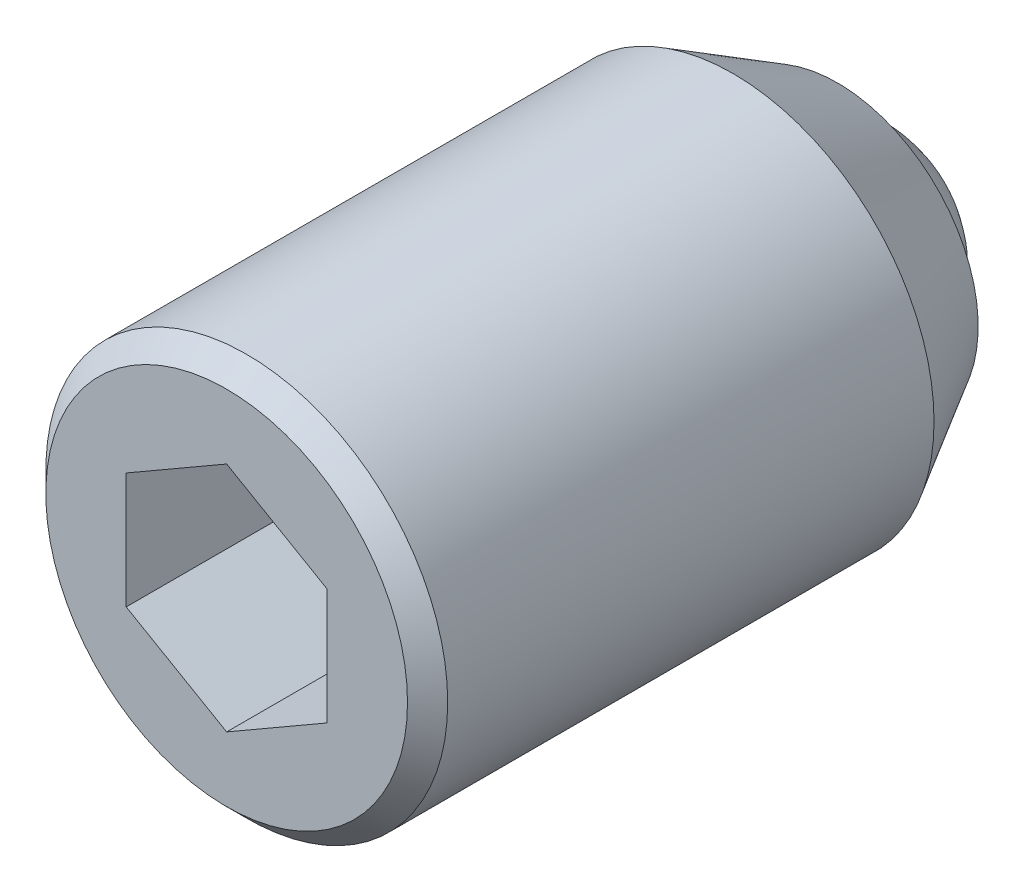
ISO-10303-21;
HEADER;
FILE_DESCRIPTION(('STEP AP214'),'2;1');
FILE_NAME('part.step','',(''),(''),'','','');
FILE_SCHEMA(('AUTOMOTIVE_DESIGN { 1 0 10303 214 1 1 1 1 }'));
ENDSEC;
DATA;
#1=APPLICATION_CONTEXT('core data for automotive mechanical design processes');
#2=APPLICATION_PROTOCOL_DEFINITION('international standard','automotive_design',2000,#1);
#3=PRODUCT_CONTEXT('',#1,'mechanical');
#4=PRODUCT('Part','Part','',(#3));
#5=PRODUCT_RELATED_PRODUCT_CATEGORY('part','',(#4));
#6=PRODUCT_DEFINITION_FORMATION('','',#4);
#7=PRODUCT_DEFINITION_CONTEXT('part definition',#1,'design');
#8=PRODUCT_DEFINITION('design','',#6,#7);
#9=PRODUCT_DEFINITION_SHAPE('','',#8);
#10=(LENGTH_UNIT() NAMED_UNIT(*) SI_UNIT(.MILLI.,.METRE.));
#11=(NAMED_UNIT(*) PLANE_ANGLE_UNIT() SI_UNIT($,.RADIAN.));
#12=(NAMED_UNIT(*) SI_UNIT($,.STERADIAN.) SOLID_ANGLE_UNIT());
#13=UNCERTAINTY_MEASURE_WITH_UNIT(LENGTH_MEASURE(1.E-05),#10,'distance_accuracy_value','');
#14=(GEOMETRIC_REPRESENTATION_CONTEXT(3) GLOBAL_UNCERTAINTY_ASSIGNED_CONTEXT((#13)) GLOBAL_UNIT_ASSIGNED_CONTEXT((#10,
#11,#12)) REPRESENTATION_CONTEXT('',''));
#15=CARTESIAN_POINT('',(0.,0.,0.));
#16=DIRECTION('',(0.,0.,1.));
#17=DIRECTION('',(1.,0.,0.));
#18=AXIS2_PLACEMENT_3D('',#15,#16,#17);
#19=CARTESIAN_POINT('',(1.25,0.721687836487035,6.1));
#20=DIRECTION('',(0.5,0.866025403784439,0.));
#21=DIRECTION('',(0.866025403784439,-0.5,0.));
#22=AXIS2_PLACEMENT_3D('',#19,#20,#21);
#23=PLANE('',#22);
#24=DIRECTION('',(0.,0.,1.));
#25=VECTOR('',#24,1.);
#26=CARTESIAN_POINT('',(1.25,0.721687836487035,6.1));
#27=LINE('',#26,#25);
#28=CARTESIAN_POINT('',(1.25,0.721687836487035,6.1));
#29=VERTEX_POINT('',#28);
#30=CARTESIAN_POINT('',(1.25,0.721687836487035,8.6));
#31=VERTEX_POINT('',#30);
#32=EDGE_CURVE('E96',#29,#31,#27,.T.);
#33=ORIENTED_EDGE('',*,*,#32,.T.);
#34=DIRECTION('',(-0.866025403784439,0.5,0.));
#35=VECTOR('',#34,1.);
#36=CARTESIAN_POINT('',(1.25,0.721687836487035,8.6));
#37=LINE('',#36,#35);
#38=CARTESIAN_POINT('',(0.,1.44337567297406,8.6));
#39=VERTEX_POINT('',#38);
#40=EDGE_CURVE('E29',#31,#39,#37,.T.);
#41=ORIENTED_EDGE('',*,*,#40,.T.);
#42=DIRECTION('',(0.,0.,1.));
#43=VECTOR('',#42,1.);
#44=CARTESIAN_POINT('',(0.,1.44337567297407,6.1));
#45=LINE('',#44,#43);
#46=CARTESIAN_POINT('',(0.,1.44337567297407,6.1));
#47=VERTEX_POINT('',#46);
#48=EDGE_CURVE('E34',#47,#39,#45,.T.);
#49=ORIENTED_EDGE('',*,*,#48,.F.);
#50=DIRECTION('',(-0.866025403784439,0.5,0.));
#51=VECTOR('',#50,1.);
#52=CARTESIAN_POINT('',(1.25,0.721687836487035,6.1));
#53=LINE('',#52,#51);
#54=EDGE_CURVE('E90',#29,#47,#53,.T.);
#55=ORIENTED_EDGE('',*,*,#54,.F.);
#56=EDGE_LOOP('',(#33,#41,#49,#55));
#57=FACE_BOUND('',#56,.T.);
#58=ADVANCED_FACE('F14',(#57),#23,.F.);
#59=CARTESIAN_POINT('',(1.25,-0.721687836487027,6.1));
#60=DIRECTION('',(1.,0.,0.));
#61=DIRECTION('',(0.,-1.,0.));
#62=AXIS2_PLACEMENT_3D('',#59,#60,#61);
#63=PLANE('',#62);
#64=DIRECTION('',(0.,0.,1.));
#65=VECTOR('',#64,1.);
#66=CARTESIAN_POINT('',(1.25,-0.721687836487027,6.1));
#67=LINE('',#66,#65);
#68=CARTESIAN_POINT('',(1.25,-0.721687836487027,6.1));
#69=VERTEX_POINT('',#68);
#70=CARTESIAN_POINT('',(1.25,-0.721687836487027,8.6));
#71=VERTEX_POINT('',#70);
#72=EDGE_CURVE('E93',#69,#71,#67,.T.);
#73=ORIENTED_EDGE('',*,*,#72,.T.);
#74=DIRECTION('',(0.,1.,0.));
#75=VECTOR('',#74,1.);
#76=CARTESIAN_POINT('',(1.25,-0.721687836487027,8.6));
#77=LINE('',#76,#75);
#78=EDGE_CURVE('E150',#71,#31,#77,.T.);
#79=ORIENTED_EDGE('',*,*,#78,.T.);
#80=ORIENTED_EDGE('',*,*,#32,.F.);
#81=DIRECTION('',(0.,1.,0.));
#82=VECTOR('',#81,1.);
#83=CARTESIAN_POINT('',(1.25,-0.721687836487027,6.1));
#84=LINE('',#83,#82);
#85=EDGE_CURVE('E85',#69,#29,#84,.T.);
#86=ORIENTED_EDGE('',*,*,#85,.F.);
#87=EDGE_LOOP('',(#73,#79,#80,#86));
#88=FACE_BOUND('',#87,.T.);
#89=ADVANCED_FACE('F119',(#88),#63,.F.);
#90=CARTESIAN_POINT('',(1.25,-0.721687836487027,6.1));
#91=DIRECTION('',(-0.5,0.866025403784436,0.));
#92=DIRECTION('',(0.866025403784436,0.5,0.));
#93=AXIS2_PLACEMENT_3D('',#90,#91,#92);
#94=PLANE('',#93);
#95=DIRECTION('',(0.,0.,1.));
#96=VECTOR('',#95,1.);
#97=CARTESIAN_POINT('',(0.,-1.44337567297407,6.1));
#98=LINE('',#97,#96);
#99=CARTESIAN_POINT('',(0.,-1.44337567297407,6.1));
#100=VERTEX_POINT('',#99);
#101=CARTESIAN_POINT('',(0.,-1.44337567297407,8.6));
#102=VERTEX_POINT('',#101);
#103=EDGE_CURVE('E68',#100,#102,#98,.T.);
#104=ORIENTED_EDGE('',*,*,#103,.T.);
#105=DIRECTION('',(-0.866025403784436,-0.5,0.));
#106=VECTOR('',#105,1.);
#107=CARTESIAN_POINT('',(1.25,-0.721687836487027,8.6));
#108=LINE('',#107,#106);
#109=EDGE_CURVE('E144',#71,#102,#108,.T.);
#110=ORIENTED_EDGE('',*,*,#109,.F.);
#111=ORIENTED_EDGE('',*,*,#72,.F.);
#112=DIRECTION('',(-0.866025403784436,-0.5,0.));
#113=VECTOR('',#112,1.);
#114=CARTESIAN_POINT('',(1.25,-0.721687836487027,6.1));
#115=LINE('',#114,#113);
#116=EDGE_CURVE('E83',#69,#100,#115,.T.);
#117=ORIENTED_EDGE('',*,*,#116,.T.);
#118=EDGE_LOOP('',(#104,#110,#111,#117));
#119=FACE_BOUND('',#118,.T.);
#120=ADVANCED_FACE('F124',(#119),#94,.T.);
#121=CARTESIAN_POINT('',(-1.25,-0.721687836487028,6.1));
#122=DIRECTION('',(-0.5,-0.866025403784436,0.));
#123=DIRECTION('',(-0.866025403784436,0.5,0.));
#124=AXIS2_PLACEMENT_3D('',#121,#122,#123);
#125=PLANE('',#124);
#126=DIRECTION('',(0.,0.,1.));
#127=VECTOR('',#126,1.);
#128=CARTESIAN_POINT('',(-1.25,-0.721687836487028,6.1));
#129=LINE('',#128,#127);
#130=CARTESIAN_POINT('',(-1.25,-0.721687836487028,6.1));
#131=VERTEX_POINT('',#130);
#132=CARTESIAN_POINT('',(-1.25,-0.721687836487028,8.6));
#133=VERTEX_POINT('',#132);
#134=EDGE_CURVE('E56',#131,#133,#129,.T.);
#135=ORIENTED_EDGE('',*,*,#134,.T.);
#136=DIRECTION('',(0.866025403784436,-0.5,0.));
#137=VECTOR('',#136,1.);
#138=CARTESIAN_POINT('',(-1.25,-0.721687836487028,8.6));
#139=LINE('',#138,#137);
#140=EDGE_CURVE('E147',#133,#102,#139,.T.);
#141=ORIENTED_EDGE('',*,*,#140,.T.);
#142=ORIENTED_EDGE('',*,*,#103,.F.);
#143=DIRECTION('',(0.866025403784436,-0.5,0.));
#144=VECTOR('',#143,1.);
#145=CARTESIAN_POINT('',(-1.25,-0.721687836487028,6.1));
#146=LINE('',#145,#144);
#147=EDGE_CURVE('E76',#131,#100,#146,.T.);
#148=ORIENTED_EDGE('',*,*,#147,.F.);
#149=EDGE_LOOP('',(#135,#141,#142,#148));
#150=FACE_BOUND('',#149,.T.);
#151=ADVANCED_FACE('F81',(#150),#125,.F.);
#152=CARTESIAN_POINT('',(-1.25,-0.721687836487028,6.1));
#153=DIRECTION('',(1.,0.,0.));
#154=DIRECTION('',(0.,0.,1.));
#155=AXIS2_PLACEMENT_3D('',#152,#153,#154);
#156=PLANE('',#155);
#157=DIRECTION('',(0.,0.,1.));
#158=VECTOR('',#157,1.);
#159=CARTESIAN_POINT('',(-1.25,0.72168783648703,6.1));
#160=LINE('',#159,#158);
#161=CARTESIAN_POINT('',(-1.25,0.72168783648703,6.1));
#162=VERTEX_POINT('',#161);
#163=CARTESIAN_POINT('',(-1.25,0.72168783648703,8.6));
#164=VERTEX_POINT('',#163);
#165=EDGE_CURVE('E69',#162,#164,#160,.T.);
#166=ORIENTED_EDGE('',*,*,#165,.T.);
#167=DIRECTION('',(0.,1.,0.));
#168=VECTOR('',#167,1.);
#169=CARTESIAN_POINT('',(-1.25,-0.721687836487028,8.6));
#170=LINE('',#169,#168);
#171=EDGE_CURVE('E63',#133,#164,#170,.T.);
#172=ORIENTED_EDGE('',*,*,#171,.F.);
#173=ORIENTED_EDGE('',*,*,#134,.F.);
#174=DIRECTION('',(0.,1.,0.));
#175=VECTOR('',#174,1.);
#176=CARTESIAN_POINT('',(-1.25,-0.721687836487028,6.1));
#177=LINE('',#176,#175);
#178=EDGE_CURVE('E60',#131,#162,#177,.T.);
#179=ORIENTED_EDGE('',*,*,#178,.T.);
#180=EDGE_LOOP('',(#166,#172,#173,#179));
#181=FACE_BOUND('',#180,.T.);
#182=ADVANCED_FACE('F59',(#181),#156,.T.);
#183=CARTESIAN_POINT('',(-1.25,0.72168783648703,6.1));
#184=DIRECTION('',(0.5,-0.866025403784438,0.));
#185=DIRECTION('',(-0.866025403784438,-0.5,0.));
#186=AXIS2_PLACEMENT_3D('',#183,#184,#185);
#187=PLANE('',#186);
#188=DIRECTION('',(0.866025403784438,0.5,0.));
#189=VECTOR('',#188,1.);
#190=CARTESIAN_POINT('',(-1.25,0.72168783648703,6.1));
#191=LINE('',#190,#189);
#192=EDGE_CURVE('E79',#162,#47,#191,.T.);
#193=ORIENTED_EDGE('',*,*,#192,.T.);
#194=ORIENTED_EDGE('',*,*,#48,.T.);
#195=DIRECTION('',(0.866025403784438,0.5,0.));
#196=VECTOR('',#195,1.);
#197=CARTESIAN_POINT('',(-1.25,0.72168783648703,8.6));
#198=LINE('',#197,#196);
#199=EDGE_CURVE('E157',#164,#39,#198,.T.);
#200=ORIENTED_EDGE('',*,*,#199,.F.);
#201=ORIENTED_EDGE('',*,*,#165,.F.);
#202=EDGE_LOOP('',(#193,#194,#200,#201));
#203=FACE_BOUND('',#202,.T.);
#204=ADVANCED_FACE('F128',(#203),#187,.T.);
#205=CARTESIAN_POINT('',(2.5,0.,6.1));
#206=DIRECTION('',(0.,0.,1.));
#207=DIRECTION('',(-1.,0.,0.));
#208=AXIS2_PLACEMENT_3D('',#205,#206,#207);
#209=PLANE('',#208);
#210=ORIENTED_EDGE('',*,*,#54,.T.);
#211=ORIENTED_EDGE('',*,*,#192,.F.);
#212=ORIENTED_EDGE('',*,*,#178,.F.);
#213=ORIENTED_EDGE('',*,*,#147,.T.);
#214=ORIENTED_EDGE('',*,*,#116,.F.);
#215=ORIENTED_EDGE('',*,*,#85,.T.);
#216=EDGE_LOOP('',(#210,#211,#212,#213,#214,#215));
#217=FACE_BOUND('',#216,.T.);
#218=ADVANCED_FACE('F74',(#217),#209,.T.);
#219=CARTESIAN_POINT('',(0.,0.,8.35));
#220=DIRECTION('',(0.,0.,-1.));
#221=DIRECTION('',(1.,0.,0.));
#222=AXIS2_PLACEMENT_3D('',#219,#220,#221);
#223=CYLINDRICAL_SURFACE('',#222,2.5);
#224=CARTESIAN_POINT('',(0.,0.,8.35));
#225=DIRECTION('',(0.,0.,-1.));
#226=DIRECTION('',(1.,0.,0.));
#227=AXIS2_PLACEMENT_3D('',#224,#225,#226);
#228=CIRCLE('',#227,2.5);
#229=CARTESIAN_POINT('',(2.5,0.,8.35));
#230=VERTEX_POINT('',#229);
#231=EDGE_CURVE('E9',#230,#230,#228,.T.);
#232=ORIENTED_EDGE('',*,*,#231,.T.);
#233=EDGE_LOOP('',(#232));
#234=FACE_BOUND('',#233,.T.);
#235=CARTESIAN_POINT('',(0.,0.,2.29903810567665));
#236=DIRECTION('',(0.,0.,-1.));
#237=DIRECTION('',(-1.,0.,0.));
#238=AXIS2_PLACEMENT_3D('',#235,#236,#237);
#239=CIRCLE('',#238,2.5);
#240=CARTESIAN_POINT('',(-2.5,0.,2.29903810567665));
#241=VERTEX_POINT('',#240);
#242=EDGE_CURVE('E172',#241,#241,#239,.T.);
#243=ORIENTED_EDGE('',*,*,#242,.F.);
#244=EDGE_LOOP('',(#243));
#245=FACE_BOUND('',#244,.T.);
#246=ADVANCED_FACE('F16',(#234,#245),#223,.T.);
#247=CARTESIAN_POINT('',(0.,0.,8.35));
#248=DIRECTION('',(0.,0.,-1.));
#249=DIRECTION('',(1.,0.,0.));
#250=AXIS2_PLACEMENT_3D('',#247,#248,#249);
#251=CONICAL_SURFACE('',#250,2.5,0.785398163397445);
#252=CARTESIAN_POINT('',(0.,0.,8.6));
#253=DIRECTION('',(0.,0.,-1.));
#254=DIRECTION('',(1.,0.,0.));
#255=AXIS2_PLACEMENT_3D('',#252,#253,#254);
#256=CIRCLE('',#255,2.25);
#257=CARTESIAN_POINT('',(2.25,0.,8.6));
#258=VERTEX_POINT('',#257);
#259=EDGE_CURVE('E22',#258,#258,#256,.T.);
#260=ORIENTED_EDGE('',*,*,#259,.T.);
#261=EDGE_LOOP('',(#260));
#262=FACE_BOUND('',#261,.T.);
#263=ORIENTED_EDGE('',*,*,#231,.F.);
#264=EDGE_LOOP('',(#263));
#265=FACE_BOUND('',#264,.T.);
#266=ADVANCED_FACE('F100',(#262,#265),#251,.T.);
#267=CARTESIAN_POINT('',(0.,0.,8.6));
#268=DIRECTION('',(0.,0.,-1.));
#269=DIRECTION('',(1.,0.,0.));
#270=AXIS2_PLACEMENT_3D('',#267,#268,#269);
#271=PLANE('',#270);
#272=ORIENTED_EDGE('',*,*,#199,.T.);
#273=ORIENTED_EDGE('',*,*,#40,.F.);
#274=ORIENTED_EDGE('',*,*,#78,.F.);
#275=ORIENTED_EDGE('',*,*,#109,.T.);
#276=ORIENTED_EDGE('',*,*,#140,.F.);
#277=ORIENTED_EDGE('',*,*,#171,.T.);
#278=EDGE_LOOP('',(#272,#273,#274,#275,#276,#277));
#279=FACE_BOUND('',#278,.T.);
#280=ORIENTED_EDGE('',*,*,#259,.F.);
#281=EDGE_LOOP('',(#280));
#282=FACE_BOUND('',#281,.T.);
#283=ADVANCED_FACE('F103',(#279,#282),#271,.F.);
#284=CARTESIAN_POINT('',(0.,0.,1.5));
#285=DIRECTION('',(0.,0.,-1.));
#286=DIRECTION('',(-1.,0.,0.));
#287=AXIS2_PLACEMENT_3D('',#284,#285,#286);
#288=SPHERICAL_SURFACE('',#287,1.5);
#289=CARTESIAN_POINT('',(0.,0.,1.));
#290=DIRECTION('',(0.,0.,-1.));
#291=DIRECTION('',(-1.,0.,0.));
#292=AXIS2_PLACEMENT_3D('',#289,#290,#291);
#293=CIRCLE('',#292,1.41421356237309);
#294=CARTESIAN_POINT('',(-1.41421356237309,0.,1.));
#295=VERTEX_POINT('',#294);
#296=EDGE_CURVE('E152',#295,#295,#293,.T.);
#297=ORIENTED_EDGE('',*,*,#296,.T.);
#298=EDGE_LOOP('',(#297));
#299=FACE_BOUND('',#298,.T.);
#300=ADVANCED_FACE('F105',(#299),#288,.T.);
#301=CARTESIAN_POINT('',(-1.41421356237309,0.,1.));
#302=DIRECTION('',(0.,0.,-1.));
#303=DIRECTION('',(-1.,0.,0.));
#304=AXIS2_PLACEMENT_3D('',#301,#302,#303);
#305=PLANE('',#304);
#306=CARTESIAN_POINT('',(0.,0.,1.));
#307=DIRECTION('',(0.,0.,-1.));
#308=DIRECTION('',(-1.,0.,0.));
#309=AXIS2_PLACEMENT_3D('',#306,#307,#308);
#310=CIRCLE('',#309,1.75);
#311=CARTESIAN_POINT('',(-1.75,0.,1.));
#312=VERTEX_POINT('',#311);
#313=EDGE_CURVE('E169',#312,#312,#310,.T.);
#314=ORIENTED_EDGE('',*,*,#313,.T.);
#315=EDGE_LOOP('',(#314));
#316=FACE_BOUND('',#315,.T.);
#317=ORIENTED_EDGE('',*,*,#296,.F.);
#318=EDGE_LOOP('',(#317));
#319=FACE_BOUND('',#318,.T.);
#320=ADVANCED_FACE('F113',(#316,#319),#305,.T.);
#321=CARTESIAN_POINT('',(0.,0.,1.));
#322=DIRECTION('',(0.,0.,1.));
#323=DIRECTION('',(1.,0.,0.));
#324=AXIS2_PLACEMENT_3D('',#321,#322,#323);
#325=CONICAL_SURFACE('',#324,1.75,0.523598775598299);
#326=ORIENTED_EDGE('',*,*,#242,.T.);
#327=EDGE_LOOP('',(#326));
#328=FACE_BOUND('',#327,.T.);
#329=ORIENTED_EDGE('',*,*,#313,.F.);
#330=EDGE_LOOP('',(#329));
#331=FACE_BOUND('',#330,.T.);
#332=ADVANCED_FACE('F176',(#328,#331),#325,.T.);
#333=CLOSED_SHELL('',(#58,#89,#120,#151,#182,#204,#218,#246,#266,#283,#300,#320,#332));
#334=MANIFOLD_SOLID_BREP('B1',#333);
#335=ADVANCED_BREP_SHAPE_REPRESENTATION('',(#18,#334),#14);
#336=SHAPE_DEFINITION_REPRESENTATION(#9,#335);
ENDSEC;
END-ISO-10303-21;
